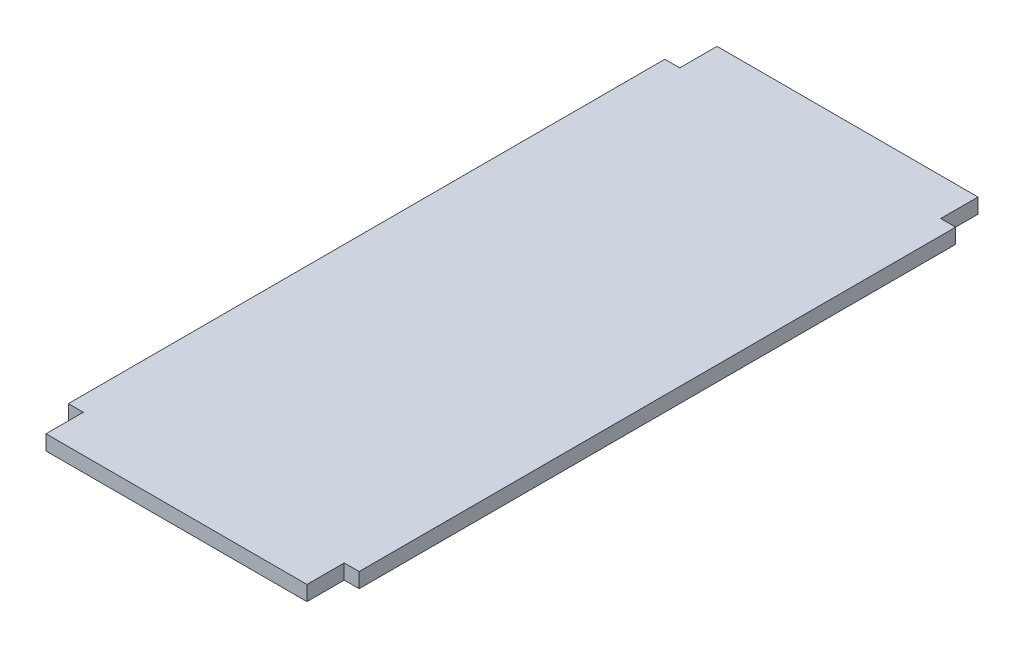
from build123d import *

# Parameters (mm, degrees)
SKETCH_1_W      = 35
SKETCH_1_H      = 90
SKETCH_1_W_2    = 2
SKETCH_1_H_2    = 80
EXTRUDE_1_DEPTH = 2


with BuildPart() as part:
    # Sketch 1 → Extrude 1 (new body)
    with BuildSketch(Plane(origin=(0, 0, 0), x_dir=(1, 0, 0), z_dir=(0, 1, 0))):
        with Locations((17.5, 45)):
            Rectangle(SKETCH_1_W, SKETCH_1_H)
        with Locations((36, 45)):
            Rectangle(SKETCH_1_W_2, SKETCH_1_H_2)
        with Locations((-1, 45)):
            Rectangle(SKETCH_1_W_2, SKETCH_1_H_2)
    extrude(amount=EXTRUDE_1_DEPTH)


solid = part.part
